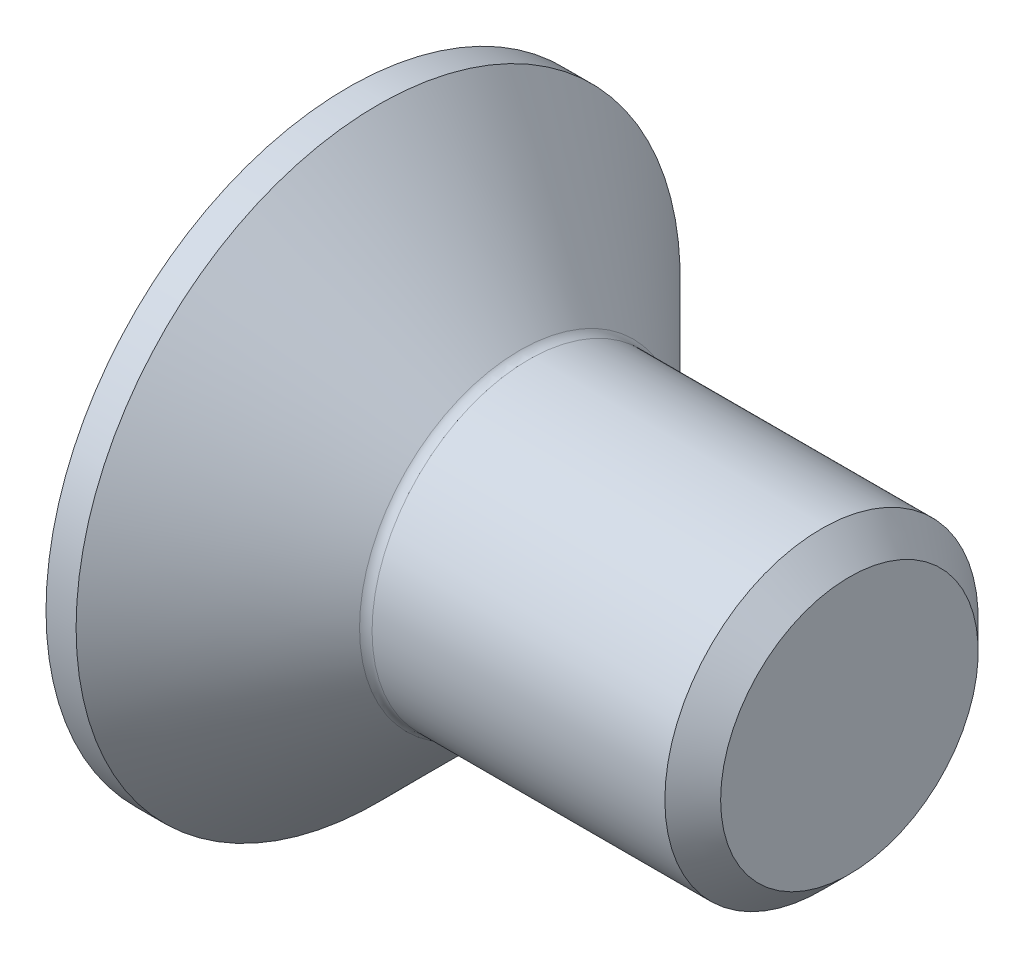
ISO-10303-21;
HEADER;
FILE_DESCRIPTION(('STEP AP214'),'2;1');
FILE_NAME('part.step','',(''),(''),'','','');
FILE_SCHEMA(('AUTOMOTIVE_DESIGN { 1 0 10303 214 1 1 1 1 }'));
ENDSEC;
DATA;
#1=APPLICATION_CONTEXT('core data for automotive mechanical design processes');
#2=APPLICATION_PROTOCOL_DEFINITION('international standard','automotive_design',2000,#1);
#3=PRODUCT_CONTEXT('',#1,'mechanical');
#4=PRODUCT('Part','Part','',(#3));
#5=PRODUCT_RELATED_PRODUCT_CATEGORY('part','',(#4));
#6=PRODUCT_DEFINITION_FORMATION('','',#4);
#7=PRODUCT_DEFINITION_CONTEXT('part definition',#1,'design');
#8=PRODUCT_DEFINITION('design','',#6,#7);
#9=PRODUCT_DEFINITION_SHAPE('','',#8);
#10=(LENGTH_UNIT() NAMED_UNIT(*) SI_UNIT(.MILLI.,.METRE.));
#11=(NAMED_UNIT(*) PLANE_ANGLE_UNIT() SI_UNIT($,.RADIAN.));
#12=(NAMED_UNIT(*) SI_UNIT($,.STERADIAN.) SOLID_ANGLE_UNIT());
#13=UNCERTAINTY_MEASURE_WITH_UNIT(LENGTH_MEASURE(1.E-05),#10,'distance_accuracy_value','');
#14=(GEOMETRIC_REPRESENTATION_CONTEXT(3) GLOBAL_UNCERTAINTY_ASSIGNED_CONTEXT((#13)) GLOBAL_UNIT_ASSIGNED_CONTEXT((#10,
#11,#12)) REPRESENTATION_CONTEXT('',''));
#15=CARTESIAN_POINT('',(0.,0.,0.));
#16=DIRECTION('',(0.,0.,1.));
#17=DIRECTION('',(1.,0.,0.));
#18=AXIS2_PLACEMENT_3D('',#15,#16,#17);
#19=CARTESIAN_POINT('',(0.,0.,0.));
#20=DIRECTION('',(-1.,0.,0.));
#21=DIRECTION('',(0.,0.,1.));
#22=AXIS2_PLACEMENT_3D('',#19,#20,#21);
#23=PLANE('',#22);
#24=CARTESIAN_POINT('',(0.,0.,0.));
#25=DIRECTION('',(-1.,0.,0.));
#26=DIRECTION('',(0.,0.,1.));
#27=AXIS2_PLACEMENT_3D('',#24,#25,#26);
#28=CIRCLE('',#27,4.82);
#29=CARTESIAN_POINT('',(0.,0.,4.82));
#30=VERTEX_POINT('',#29);
#31=EDGE_CURVE('E177',#30,#30,#28,.T.);
#32=ORIENTED_EDGE('',*,*,#31,.T.);
#33=EDGE_LOOP('',(#32));
#34=FACE_BOUND('',#33,.T.);
#35=DIRECTION('',(0.,-0.5,-0.866025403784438));
#36=VECTOR('',#35,1.);
#37=CARTESIAN_POINT('',(0.,-0.871798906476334,1.51));
#38=LINE('',#37,#36);
#39=CARTESIAN_POINT('',(0.,-0.871798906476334,1.51));
#40=VERTEX_POINT('',#39);
#41=CARTESIAN_POINT('',(0.,-1.74359781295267,0.));
#42=VERTEX_POINT('',#41);
#43=EDGE_CURVE('E131',#40,#42,#38,.T.);
#44=ORIENTED_EDGE('',*,*,#43,.T.);
#45=DIRECTION('',(0.,0.5,-0.866025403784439));
#46=VECTOR('',#45,1.);
#47=CARTESIAN_POINT('',(0.,-1.74359781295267,0.));
#48=LINE('',#47,#46);
#49=CARTESIAN_POINT('',(0.,-0.871798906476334,-1.51));
#50=VERTEX_POINT('',#49);
#51=EDGE_CURVE('E60',#42,#50,#48,.T.);
#52=ORIENTED_EDGE('',*,*,#51,.T.);
#53=DIRECTION('',(0.,1.,0.));
#54=VECTOR('',#53,1.);
#55=CARTESIAN_POINT('',(0.,-0.871798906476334,-1.51));
#56=LINE('',#55,#54);
#57=CARTESIAN_POINT('',(0.,0.871798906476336,-1.51));
#58=VERTEX_POINT('',#57);
#59=EDGE_CURVE('E147',#50,#58,#56,.T.);
#60=ORIENTED_EDGE('',*,*,#59,.T.);
#61=DIRECTION('',(0.,0.5,0.866025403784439));
#62=VECTOR('',#61,1.);
#63=CARTESIAN_POINT('',(0.,0.871798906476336,-1.51));
#64=LINE('',#63,#62);
#65=CARTESIAN_POINT('',(0.,1.74359781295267,0.));
#66=VERTEX_POINT('',#65);
#67=EDGE_CURVE('E305',#58,#66,#64,.T.);
#68=ORIENTED_EDGE('',*,*,#67,.T.);
#69=DIRECTION('',(0.,-0.5,0.866025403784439));
#70=VECTOR('',#69,1.);
#71=CARTESIAN_POINT('',(0.,1.74359781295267,0.));
#72=LINE('',#71,#70);
#73=CARTESIAN_POINT('',(0.,0.871798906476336,1.51));
#74=VERTEX_POINT('',#73);
#75=EDGE_CURVE('E309',#66,#74,#72,.T.);
#76=ORIENTED_EDGE('',*,*,#75,.T.);
#77=DIRECTION('',(0.,-1.,0.));
#78=VECTOR('',#77,1.);
#79=CARTESIAN_POINT('',(0.,0.871798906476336,1.51));
#80=LINE('',#79,#78);
#81=EDGE_CURVE('E313',#74,#40,#80,.T.);
#82=ORIENTED_EDGE('',*,*,#81,.T.);
#83=EDGE_LOOP('',(#44,#52,#60,#68,#76,#82));
#84=FACE_BOUND('',#83,.T.);
#85=ADVANCED_FACE('F44',(#34,#84),#23,.T.);
#86=CARTESIAN_POINT('',(0.,0.,0.));
#87=DIRECTION('',(-1.,0.,0.));
#88=DIRECTION('',(0.,0.,1.));
#89=AXIS2_PLACEMENT_3D('',#86,#87,#88);
#90=CYLINDRICAL_SURFACE('',#89,4.82);
#91=CARTESIAN_POINT('',(0.480000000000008,0.,0.));
#92=DIRECTION('',(-1.,0.,0.));
#93=DIRECTION('',(0.,0.,1.));
#94=AXIS2_PLACEMENT_3D('',#91,#92,#93);
#95=CIRCLE('',#94,4.82);
#96=CARTESIAN_POINT('',(0.480000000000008,0.,4.82));
#97=VERTEX_POINT('',#96);
#98=EDGE_CURVE('E173',#97,#97,#95,.T.);
#99=ORIENTED_EDGE('',*,*,#98,.T.);
#100=EDGE_LOOP('',(#99));
#101=FACE_BOUND('',#100,.T.);
#102=ORIENTED_EDGE('',*,*,#31,.F.);
#103=EDGE_LOOP('',(#102));
#104=FACE_BOUND('',#103,.T.);
#105=ADVANCED_FACE('F200',(#101,#104),#90,.T.);
#106=CARTESIAN_POINT('',(0.480000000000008,0.,0.));
#107=DIRECTION('',(-1.,0.,0.));
#108=DIRECTION('',(0.,0.,1.));
#109=AXIS2_PLACEMENT_3D('',#106,#107,#108);
#110=CONICAL_SURFACE('',#109,4.82,0.78539816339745);
#111=CARTESIAN_POINT('',(2.74142135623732,0.,0.));
#112=DIRECTION('',(-1.,0.,0.));
#113=DIRECTION('',(0.,0.,1.));
#114=AXIS2_PLACEMENT_3D('',#111,#112,#113);
#115=CIRCLE('',#114,2.55857864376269);
#116=CARTESIAN_POINT('',(2.74142135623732,0.,2.55857864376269));
#117=VERTEX_POINT('',#116);
#118=EDGE_CURVE('E53',#117,#117,#115,.T.);
#119=ORIENTED_EDGE('',*,*,#118,.T.);
#120=EDGE_LOOP('',(#119));
#121=FACE_BOUND('',#120,.T.);
#122=ORIENTED_EDGE('',*,*,#98,.F.);
#123=EDGE_LOOP('',(#122));
#124=FACE_BOUND('',#123,.T.);
#125=ADVANCED_FACE('F184',(#121,#124),#110,.T.);
#126=CARTESIAN_POINT('',(0.,0.,0.));
#127=DIRECTION('',(-1.,0.,0.));
#128=DIRECTION('',(0.,0.,1.));
#129=AXIS2_PLACEMENT_3D('',#126,#127,#128);
#130=CYLINDRICAL_SURFACE('',#129,2.49999999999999);
#131=CARTESIAN_POINT('',(2.88284271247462,0.,0.));
#132=DIRECTION('',(-1.,0.,0.));
#133=DIRECTION('',(0.,0.,1.));
#134=AXIS2_PLACEMENT_3D('',#131,#132,#133);
#135=CIRCLE('',#134,2.49999999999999);
#136=CARTESIAN_POINT('',(2.88284271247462,0.,2.49999999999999));
#137=VERTEX_POINT('',#136);
#138=EDGE_CURVE('E11',#137,#137,#135,.F.);
#139=ORIENTED_EDGE('',*,*,#138,.T.);
#140=EDGE_LOOP('',(#139));
#141=FACE_BOUND('',#140,.T.);
#142=CARTESIAN_POINT('',(7.555,0.,0.));
#143=DIRECTION('',(-1.,0.,0.));
#144=DIRECTION('',(0.,0.,1.));
#145=AXIS2_PLACEMENT_3D('',#142,#143,#144);
#146=CIRCLE('',#145,2.49999999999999);
#147=CARTESIAN_POINT('',(7.555,0.,2.49999999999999));
#148=VERTEX_POINT('',#147);
#149=EDGE_CURVE('E169',#148,#148,#146,.T.);
#150=ORIENTED_EDGE('',*,*,#149,.T.);
#151=EDGE_LOOP('',(#150));
#152=FACE_BOUND('',#151,.T.);
#153=ADVANCED_FACE('F211',(#141,#152),#130,.T.);
#154=CARTESIAN_POINT('',(8.,0.,0.));
#155=DIRECTION('',(-1.,0.,0.));
#156=DIRECTION('',(0.,0.,1.));
#157=AXIS2_PLACEMENT_3D('',#154,#155,#156);
#158=CONICAL_SURFACE('',#157,2.055,0.785398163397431);
#159=ORIENTED_EDGE('',*,*,#149,.F.);
#160=EDGE_LOOP('',(#159));
#161=FACE_BOUND('',#160,.T.);
#162=CARTESIAN_POINT('',(8.,0.,0.));
#163=DIRECTION('',(-1.,0.,0.));
#164=DIRECTION('',(0.,0.,1.));
#165=AXIS2_PLACEMENT_3D('',#162,#163,#164);
#166=CIRCLE('',#165,2.055);
#167=CARTESIAN_POINT('',(8.,0.,2.055));
#168=VERTEX_POINT('',#167);
#169=EDGE_CURVE('E164',#168,#168,#166,.T.);
#170=ORIENTED_EDGE('',*,*,#169,.T.);
#171=EDGE_LOOP('',(#170));
#172=FACE_BOUND('',#171,.T.);
#173=ADVANCED_FACE('F195',(#161,#172),#158,.T.);
#174=CARTESIAN_POINT('',(8.,2.055,0.));
#175=DIRECTION('',(1.,0.,0.));
#176=DIRECTION('',(0.,0.,-1.));
#177=AXIS2_PLACEMENT_3D('',#174,#175,#176);
#178=PLANE('',#177);
#179=ORIENTED_EDGE('',*,*,#169,.F.);
#180=EDGE_LOOP('',(#179));
#181=FACE_BOUND('',#180,.T.);
#182=ADVANCED_FACE('F188',(#181),#178,.T.);
#183=CARTESIAN_POINT('',(2.88284271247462,0.,0.));
#184=DIRECTION('',(-1.,0.,0.));
#185=DIRECTION('',(0.,0.,1.));
#186=AXIS2_PLACEMENT_3D('',#183,#184,#185);
#187=TOROIDAL_SURFACE('',#186,2.69999999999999,0.2);
#188=ORIENTED_EDGE('',*,*,#138,.F.);
#189=EDGE_LOOP('',(#188));
#190=FACE_BOUND('',#189,.T.);
#191=ORIENTED_EDGE('',*,*,#118,.F.);
#192=EDGE_LOOP('',(#191));
#193=FACE_BOUND('',#192,.T.);
#194=ADVANCED_FACE('F46',(#190,#193),#187,.F.);
#195=CARTESIAN_POINT('',(2.3,-1.74359781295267,0.));
#196=DIRECTION('',(0.,0.866025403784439,0.5));
#197=DIRECTION('',(0.,-0.5,0.866025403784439));
#198=AXIS2_PLACEMENT_3D('',#195,#196,#197);
#199=PLANE('',#198);
#200=ORIENTED_EDGE('',*,*,#51,.F.);
#201=DIRECTION('',(-1.,0.,0.));
#202=VECTOR('',#201,1.);
#203=CARTESIAN_POINT('',(2.3,-1.74359781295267,0.));
#204=LINE('',#203,#202);
#205=CARTESIAN_POINT('',(2.3,-1.74359781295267,0.));
#206=VERTEX_POINT('',#205);
#207=EDGE_CURVE('E300',#206,#42,#204,.T.);
#208=ORIENTED_EDGE('',*,*,#207,.F.);
#209=DIRECTION('',(0.,0.5,-0.866025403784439));
#210=VECTOR('',#209,1.);
#211=CARTESIAN_POINT('',(2.3,-1.74359781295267,0.));
#212=LINE('',#211,#210);
#213=CARTESIAN_POINT('',(2.3,-1.3076983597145,-0.755));
#214=VERTEX_POINT('',#213);
#215=EDGE_CURVE('E127',#206,#214,#212,.T.);
#216=ORIENTED_EDGE('',*,*,#215,.T.);
#217=CARTESIAN_POINT('',(2.3,-0.871798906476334,-1.51));
#218=VERTEX_POINT('',#217);
#219=EDGE_CURVE('E121',#214,#218,#212,.T.);
#220=ORIENTED_EDGE('',*,*,#219,.T.);
#221=DIRECTION('',(-1.,0.,0.));
#222=VECTOR('',#221,1.);
#223=CARTESIAN_POINT('',(2.3,-0.871798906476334,-1.51));
#224=LINE('',#223,#222);
#225=EDGE_CURVE('E125',#218,#50,#224,.T.);
#226=ORIENTED_EDGE('',*,*,#225,.T.);
#227=EDGE_LOOP('',(#200,#208,#216,#220,#226));
#228=FACE_BOUND('',#227,.T.);
#229=ADVANCED_FACE('F123',(#228),#199,.T.);
#230=CARTESIAN_POINT('',(2.3,-0.871798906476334,-1.51));
#231=DIRECTION('',(0.,0.,1.));
#232=DIRECTION('',(0.,-1.,0.));
#233=AXIS2_PLACEMENT_3D('',#230,#231,#232);
#234=PLANE('',#233);
#235=ORIENTED_EDGE('',*,*,#59,.F.);
#236=ORIENTED_EDGE('',*,*,#225,.F.);
#237=DIRECTION('',(0.,1.,0.));
#238=VECTOR('',#237,1.);
#239=CARTESIAN_POINT('',(2.3,-0.871798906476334,-1.51));
#240=LINE('',#239,#238);
#241=CARTESIAN_POINT('',(2.3,0.,-1.51));
#242=VERTEX_POINT('',#241);
#243=EDGE_CURVE('E134',#218,#242,#240,.T.);
#244=ORIENTED_EDGE('',*,*,#243,.T.);
#245=CARTESIAN_POINT('',(2.3,0.871798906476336,-1.51));
#246=VERTEX_POINT('',#245);
#247=EDGE_CURVE('E142',#242,#246,#240,.T.);
#248=ORIENTED_EDGE('',*,*,#247,.T.);
#249=DIRECTION('',(-1.,0.,0.));
#250=VECTOR('',#249,1.);
#251=CARTESIAN_POINT('',(2.3,0.871798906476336,-1.51));
#252=LINE('',#251,#250);
#253=EDGE_CURVE('E150',#246,#58,#252,.T.);
#254=ORIENTED_EDGE('',*,*,#253,.T.);
#255=EDGE_LOOP('',(#235,#236,#244,#248,#254));
#256=FACE_BOUND('',#255,.T.);
#257=ADVANCED_FACE('F144',(#256),#234,.T.);
#258=CARTESIAN_POINT('',(2.3,0.871798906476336,-1.51));
#259=DIRECTION('',(0.,-0.866025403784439,0.5));
#260=DIRECTION('',(0.,-0.5,-0.866025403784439));
#261=AXIS2_PLACEMENT_3D('',#258,#259,#260);
#262=PLANE('',#261);
#263=ORIENTED_EDGE('',*,*,#67,.F.);
#264=ORIENTED_EDGE('',*,*,#253,.F.);
#265=DIRECTION('',(0.,0.5,0.866025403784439));
#266=VECTOR('',#265,1.);
#267=CARTESIAN_POINT('',(2.3,0.871798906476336,-1.51));
#268=LINE('',#267,#266);
#269=CARTESIAN_POINT('',(2.3,1.3076983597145,-0.755));
#270=VERTEX_POINT('',#269);
#271=EDGE_CURVE('E288',#246,#270,#268,.T.);
#272=ORIENTED_EDGE('',*,*,#271,.T.);
#273=CARTESIAN_POINT('',(2.3,1.74359781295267,0.));
#274=VERTEX_POINT('',#273);
#275=EDGE_CURVE('E141',#270,#274,#268,.T.);
#276=ORIENTED_EDGE('',*,*,#275,.T.);
#277=DIRECTION('',(-1.,0.,0.));
#278=VECTOR('',#277,1.);
#279=CARTESIAN_POINT('',(2.3,1.74359781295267,0.));
#280=LINE('',#279,#278);
#281=EDGE_CURVE('E158',#274,#66,#280,.T.);
#282=ORIENTED_EDGE('',*,*,#281,.T.);
#283=EDGE_LOOP('',(#263,#264,#272,#276,#282));
#284=FACE_BOUND('',#283,.T.);
#285=ADVANCED_FACE('F225',(#284),#262,.T.);
#286=CARTESIAN_POINT('',(2.3,1.74359781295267,0.));
#287=DIRECTION('',(0.,-0.866025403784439,-0.5));
#288=DIRECTION('',(0.,0.5,-0.866025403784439));
#289=AXIS2_PLACEMENT_3D('',#286,#287,#288);
#290=PLANE('',#289);
#291=ORIENTED_EDGE('',*,*,#75,.F.);
#292=ORIENTED_EDGE('',*,*,#281,.F.);
#293=DIRECTION('',(0.,-0.5,0.866025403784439));
#294=VECTOR('',#293,1.);
#295=CARTESIAN_POINT('',(2.3,1.74359781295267,0.));
#296=LINE('',#295,#294);
#297=CARTESIAN_POINT('',(2.3,1.3076983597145,0.755));
#298=VERTEX_POINT('',#297);
#299=EDGE_CURVE('E68',#274,#298,#296,.T.);
#300=ORIENTED_EDGE('',*,*,#299,.T.);
#301=CARTESIAN_POINT('',(2.3,0.871798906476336,1.51));
#302=VERTEX_POINT('',#301);
#303=EDGE_CURVE('E260',#298,#302,#296,.T.);
#304=ORIENTED_EDGE('',*,*,#303,.T.);
#305=DIRECTION('',(-1.,0.,0.));
#306=VECTOR('',#305,1.);
#307=CARTESIAN_POINT('',(2.3,0.871798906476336,1.51));
#308=LINE('',#307,#306);
#309=EDGE_CURVE('E275',#302,#74,#308,.T.);
#310=ORIENTED_EDGE('',*,*,#309,.T.);
#311=EDGE_LOOP('',(#291,#292,#300,#304,#310));
#312=FACE_BOUND('',#311,.T.);
#313=ADVANCED_FACE('F228',(#312),#290,.T.);
#314=CARTESIAN_POINT('',(2.3,0.871798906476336,1.51));
#315=DIRECTION('',(0.,0.,-1.));
#316=DIRECTION('',(0.,1.,0.));
#317=AXIS2_PLACEMENT_3D('',#314,#315,#316);
#318=PLANE('',#317);
#319=ORIENTED_EDGE('',*,*,#81,.F.);
#320=ORIENTED_EDGE('',*,*,#309,.F.);
#321=DIRECTION('',(0.,-1.,0.));
#322=VECTOR('',#321,1.);
#323=CARTESIAN_POINT('',(2.3,0.871798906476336,1.51));
#324=LINE('',#323,#322);
#325=CARTESIAN_POINT('',(2.3,0.,1.51));
#326=VERTEX_POINT('',#325);
#327=EDGE_CURVE('E259',#302,#326,#324,.T.);
#328=ORIENTED_EDGE('',*,*,#327,.T.);
#329=CARTESIAN_POINT('',(2.3,-0.871798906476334,1.51));
#330=VERTEX_POINT('',#329);
#331=EDGE_CURVE('E265',#326,#330,#324,.T.);
#332=ORIENTED_EDGE('',*,*,#331,.T.);
#333=DIRECTION('',(-1.,0.,0.));
#334=VECTOR('',#333,1.);
#335=CARTESIAN_POINT('',(2.3,-0.871798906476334,1.51));
#336=LINE('',#335,#334);
#337=EDGE_CURVE('E322',#330,#40,#336,.T.);
#338=ORIENTED_EDGE('',*,*,#337,.T.);
#339=EDGE_LOOP('',(#319,#320,#328,#332,#338));
#340=FACE_BOUND('',#339,.T.);
#341=ADVANCED_FACE('F232',(#340),#318,.T.);
#342=CARTESIAN_POINT('',(2.3,-0.871798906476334,1.51));
#343=DIRECTION('',(0.,0.866025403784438,-0.5));
#344=DIRECTION('',(0.,0.5,0.866025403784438));
#345=AXIS2_PLACEMENT_3D('',#342,#343,#344);
#346=PLANE('',#345);
#347=ORIENTED_EDGE('',*,*,#43,.F.);
#348=ORIENTED_EDGE('',*,*,#337,.F.);
#349=DIRECTION('',(0.,-0.5,-0.866025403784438));
#350=VECTOR('',#349,1.);
#351=CARTESIAN_POINT('',(2.3,-0.871798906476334,1.51));
#352=LINE('',#351,#350);
#353=CARTESIAN_POINT('',(2.3,-1.3076983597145,0.755));
#354=VERTEX_POINT('',#353);
#355=EDGE_CURVE('E268',#330,#354,#352,.T.);
#356=ORIENTED_EDGE('',*,*,#355,.T.);
#357=EDGE_CURVE('E277',#354,#206,#352,.T.);
#358=ORIENTED_EDGE('',*,*,#357,.T.);
#359=ORIENTED_EDGE('',*,*,#207,.T.);
#360=EDGE_LOOP('',(#347,#348,#356,#358,#359));
#361=FACE_BOUND('',#360,.T.);
#362=ADVANCED_FACE('F235',(#361),#346,.T.);
#363=CARTESIAN_POINT('',(2.3,-1.74359781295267,0.));
#364=DIRECTION('',(-1.,0.,0.));
#365=DIRECTION('',(0.,0.,1.));
#366=AXIS2_PLACEMENT_3D('',#363,#364,#365);
#367=PLANE('',#366);
#368=CARTESIAN_POINT('',(2.3,0.,0.));
#369=DIRECTION('',(-1.,0.,0.));
#370=DIRECTION('',(0.,0.,1.));
#371=AXIS2_PLACEMENT_3D('',#368,#369,#370);
#372=CIRCLE('',#371,1.51);
#373=EDGE_CURVE('E149',#354,#326,#372,.T.);
#374=ORIENTED_EDGE('',*,*,#373,.F.);
#375=ORIENTED_EDGE('',*,*,#355,.F.);
#376=ORIENTED_EDGE('',*,*,#331,.F.);
#377=EDGE_LOOP('',(#374,#375,#376));
#378=FACE_BOUND('',#377,.T.);
#379=ADVANCED_FACE('F239',(#378),#367,.T.);
#380=EDGE_CURVE('E155',#214,#354,#372,.T.);
#381=ORIENTED_EDGE('',*,*,#380,.F.);
#382=ORIENTED_EDGE('',*,*,#215,.F.);
#383=ORIENTED_EDGE('',*,*,#357,.F.);
#384=EDGE_LOOP('',(#381,#382,#383));
#385=FACE_BOUND('',#384,.T.);
#386=ADVANCED_FACE('F242',(#385),#367,.T.);
#387=EDGE_CURVE('E136',#242,#214,#372,.T.);
#388=ORIENTED_EDGE('',*,*,#387,.F.);
#389=ORIENTED_EDGE('',*,*,#243,.F.);
#390=ORIENTED_EDGE('',*,*,#219,.F.);
#391=EDGE_LOOP('',(#388,#389,#390));
#392=FACE_BOUND('',#391,.T.);
#393=ADVANCED_FACE('F135',(#392),#367,.T.);
#394=EDGE_CURVE('E281',#270,#242,#372,.T.);
#395=ORIENTED_EDGE('',*,*,#394,.F.);
#396=ORIENTED_EDGE('',*,*,#271,.F.);
#397=ORIENTED_EDGE('',*,*,#247,.F.);
#398=EDGE_LOOP('',(#395,#396,#397));
#399=FACE_BOUND('',#398,.T.);
#400=ADVANCED_FACE('F254',(#399),#367,.T.);
#401=EDGE_CURVE('E165',#298,#270,#372,.T.);
#402=ORIENTED_EDGE('',*,*,#401,.F.);
#403=ORIENTED_EDGE('',*,*,#299,.F.);
#404=ORIENTED_EDGE('',*,*,#275,.F.);
#405=EDGE_LOOP('',(#402,#403,#404));
#406=FACE_BOUND('',#405,.T.);
#407=ADVANCED_FACE('F249',(#406),#367,.T.);
#408=EDGE_CURVE('E157',#326,#298,#372,.T.);
#409=ORIENTED_EDGE('',*,*,#408,.F.);
#410=ORIENTED_EDGE('',*,*,#327,.F.);
#411=ORIENTED_EDGE('',*,*,#303,.F.);
#412=EDGE_LOOP('',(#409,#410,#411));
#413=FACE_BOUND('',#412,.T.);
#414=ADVANCED_FACE('F220',(#413),#367,.T.);
#415=CARTESIAN_POINT('',(2.3,0.,0.));
#416=DIRECTION('',(-1.,0.,0.));
#417=DIRECTION('',(0.,0.,1.));
#418=AXIS2_PLACEMENT_3D('',#415,#416,#417);
#419=CONICAL_SURFACE('',#418,1.51,1.04719755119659);
#420=CARTESIAN_POINT('',(3.17179890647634,0.,0.));
#421=VERTEX_POINT('',#420);
#422=VERTEX_LOOP('',#421);
#423=FACE_BOUND('',#422,.T.);
#424=ORIENTED_EDGE('',*,*,#408,.T.);
#425=ORIENTED_EDGE('',*,*,#401,.T.);
#426=ORIENTED_EDGE('',*,*,#394,.T.);
#427=ORIENTED_EDGE('',*,*,#387,.T.);
#428=ORIENTED_EDGE('',*,*,#380,.T.);
#429=ORIENTED_EDGE('',*,*,#373,.T.);
#430=EDGE_LOOP('',(#424,#425,#426,#427,#428,#429));
#431=FACE_BOUND('',#430,.T.);
#432=ADVANCED_FACE('F218',(#423,#431),#419,.F.);
#433=CLOSED_SHELL('',(#85,#105,#125,#153,#173,#182,#194,#229,#257,#285,#313,#341,#362,#379,#386,
#393,#400,#407,#414,#432));
#434=MANIFOLD_SOLID_BREP('B2',#433);
#435=ADVANCED_BREP_SHAPE_REPRESENTATION('',(#18,#434),#14);
#436=SHAPE_DEFINITION_REPRESENTATION(#9,#435);
ENDSEC;
END-ISO-10303-21;
